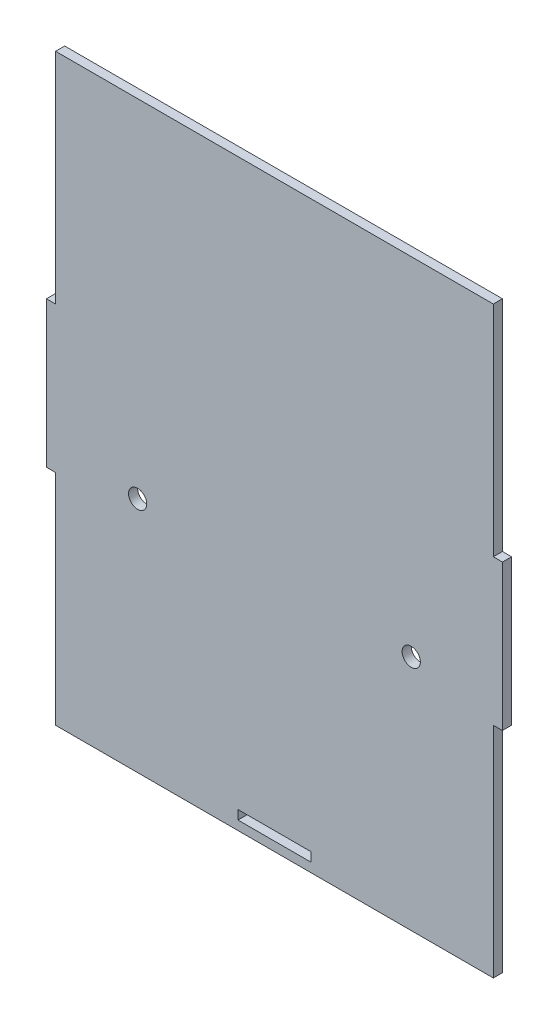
ISO-10303-21;
HEADER;
FILE_DESCRIPTION(('STEP AP214'),'2;1');
FILE_NAME('part.step','',(''),(''),'','','');
FILE_SCHEMA(('AUTOMOTIVE_DESIGN { 1 0 10303 214 1 1 1 1 }'));
ENDSEC;
DATA;
#1=APPLICATION_CONTEXT('core data for automotive mechanical design processes');
#2=APPLICATION_PROTOCOL_DEFINITION('international standard','automotive_design',2000,#1);
#3=PRODUCT_CONTEXT('',#1,'mechanical');
#4=PRODUCT('Part','Part','',(#3));
#5=PRODUCT_RELATED_PRODUCT_CATEGORY('part','',(#4));
#6=PRODUCT_DEFINITION_FORMATION('','',#4);
#7=PRODUCT_DEFINITION_CONTEXT('part definition',#1,'design');
#8=PRODUCT_DEFINITION('design','',#6,#7);
#9=PRODUCT_DEFINITION_SHAPE('','',#8);
#10=(LENGTH_UNIT() NAMED_UNIT(*) SI_UNIT(.MILLI.,.METRE.));
#11=(NAMED_UNIT(*) PLANE_ANGLE_UNIT() SI_UNIT($,.RADIAN.));
#12=(NAMED_UNIT(*) SI_UNIT($,.STERADIAN.) SOLID_ANGLE_UNIT());
#13=UNCERTAINTY_MEASURE_WITH_UNIT(LENGTH_MEASURE(1.E-05),#10,'distance_accuracy_value','');
#14=(GEOMETRIC_REPRESENTATION_CONTEXT(3) GLOBAL_UNCERTAINTY_ASSIGNED_CONTEXT((#13)) GLOBAL_UNIT_ASSIGNED_CONTEXT((#10,
#11,#12)) REPRESENTATION_CONTEXT('',''));
#15=CARTESIAN_POINT('',(0.,0.,0.));
#16=DIRECTION('',(0.,0.,1.));
#17=DIRECTION('',(1.,0.,0.));
#18=AXIS2_PLACEMENT_3D('',#15,#16,#17);
#19=CARTESIAN_POINT('',(-48.1057523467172,-47.8174502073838,3.175));
#20=DIRECTION('',(0.,0.,-1.));
#21=DIRECTION('',(-1.,0.,0.));
#22=AXIS2_PLACEMENT_3D('',#19,#20,#21);
#23=PLANE('',#22);
#24=CARTESIAN_POINT('',(-19.5307523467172,-92.2674502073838,3.175));
#25=DIRECTION('',(0.,0.,1.));
#26=DIRECTION('',(1.,0.,0.));
#27=AXIS2_PLACEMENT_3D('',#24,#25,#26);
#28=CIRCLE('',#27,3.175);
#29=CARTESIAN_POINT('',(-16.3557523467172,-92.2674502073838,3.175));
#30=VERTEX_POINT('',#29);
#31=EDGE_CURVE('E175',#30,#30,#28,.T.);
#32=ORIENTED_EDGE('',*,*,#31,.F.);
#33=EDGE_LOOP('',(#32));
#34=FACE_BOUND('',#33,.T.);
#35=DIRECTION('',(0.,-1.,0.));
#36=VECTOR('',#35,1.);
#37=CARTESIAN_POINT('',(-48.1057523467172,28.3825497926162,3.175));
#38=LINE('',#37,#36);
#39=CARTESIAN_POINT('',(-48.1057523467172,28.3825497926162,3.175));
#40=VERTEX_POINT('',#39);
#41=CARTESIAN_POINT('',(-48.1057523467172,-47.8174502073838,3.175));
#42=VERTEX_POINT('',#41);
#43=EDGE_CURVE('E185',#40,#42,#38,.T.);
#44=ORIENTED_EDGE('',*,*,#43,.T.);
#45=DIRECTION('',(-1.,0.,0.));
#46=VECTOR('',#45,1.);
#47=CARTESIAN_POINT('',(-48.1057523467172,-47.8174502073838,3.175));
#48=LINE('',#47,#46);
#49=CARTESIAN_POINT('',(-51.2807523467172,-47.8174502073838,3.175));
#50=VERTEX_POINT('',#49);
#51=EDGE_CURVE('E188',#42,#50,#48,.T.);
#52=ORIENTED_EDGE('',*,*,#51,.T.);
#53=DIRECTION('',(0.,-1.,0.));
#54=VECTOR('',#53,1.);
#55=CARTESIAN_POINT('',(-51.2807523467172,-47.8174502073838,3.175));
#56=LINE('',#55,#54);
#57=CARTESIAN_POINT('',(-51.2807523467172,-98.6174502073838,3.175));
#58=VERTEX_POINT('',#57);
#59=EDGE_CURVE('E191',#50,#58,#56,.T.);
#60=ORIENTED_EDGE('',*,*,#59,.T.);
#61=DIRECTION('',(1.,0.,0.));
#62=VECTOR('',#61,1.);
#63=CARTESIAN_POINT('',(-48.1057523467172,-98.6174502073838,3.175));
#64=LINE('',#63,#62);
#65=CARTESIAN_POINT('',(-48.1057523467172,-98.6174502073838,3.175));
#66=VERTEX_POINT('',#65);
#67=EDGE_CURVE('E193',#58,#66,#64,.T.);
#68=ORIENTED_EDGE('',*,*,#67,.T.);
#69=DIRECTION('',(0.,-1.,0.));
#70=VECTOR('',#69,1.);
#71=CARTESIAN_POINT('',(-48.1057523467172,-98.6174502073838,3.175));
#72=LINE('',#71,#70);
#73=CARTESIAN_POINT('',(-48.1057523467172,-174.817450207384,3.175));
#74=VERTEX_POINT('',#73);
#75=EDGE_CURVE('E195',#66,#74,#72,.T.);
#76=ORIENTED_EDGE('',*,*,#75,.T.);
#77=DIRECTION('',(1.,0.,0.));
#78=VECTOR('',#77,1.);
#79=CARTESIAN_POINT('',(-48.1057523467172,-174.817450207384,3.175));
#80=LINE('',#79,#78);
#81=CARTESIAN_POINT('',(104.294247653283,-174.817450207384,3.175));
#82=VERTEX_POINT('',#81);
#83=EDGE_CURVE('E197',#74,#82,#80,.T.);
#84=ORIENTED_EDGE('',*,*,#83,.T.);
#85=DIRECTION('',(0.,1.,0.));
#86=VECTOR('',#85,1.);
#87=CARTESIAN_POINT('',(104.294247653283,-98.6174502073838,3.175));
#88=LINE('',#87,#86);
#89=CARTESIAN_POINT('',(104.294247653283,-98.6174502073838,3.175));
#90=VERTEX_POINT('',#89);
#91=EDGE_CURVE('E199',#82,#90,#88,.T.);
#92=ORIENTED_EDGE('',*,*,#91,.T.);
#93=DIRECTION('',(1.,0.,0.));
#94=VECTOR('',#93,1.);
#95=CARTESIAN_POINT('',(104.294247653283,-98.6174502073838,3.175));
#96=LINE('',#95,#94);
#97=CARTESIAN_POINT('',(107.469247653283,-98.6174502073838,3.175));
#98=VERTEX_POINT('',#97);
#99=EDGE_CURVE('E201',#90,#98,#96,.T.);
#100=ORIENTED_EDGE('',*,*,#99,.T.);
#101=DIRECTION('',(0.,1.,0.));
#102=VECTOR('',#101,1.);
#103=CARTESIAN_POINT('',(107.469247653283,-47.8174502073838,3.175));
#104=LINE('',#103,#102);
#105=CARTESIAN_POINT('',(107.469247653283,-47.8174502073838,3.175));
#106=VERTEX_POINT('',#105);
#107=EDGE_CURVE('E203',#98,#106,#104,.T.);
#108=ORIENTED_EDGE('',*,*,#107,.T.);
#109=DIRECTION('',(-1.,0.,0.));
#110=VECTOR('',#109,1.);
#111=CARTESIAN_POINT('',(104.294247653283,-47.8174502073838,3.175));
#112=LINE('',#111,#110);
#113=CARTESIAN_POINT('',(104.294247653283,-47.8174502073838,3.175));
#114=VERTEX_POINT('',#113);
#115=EDGE_CURVE('E205',#106,#114,#112,.T.);
#116=ORIENTED_EDGE('',*,*,#115,.T.);
#117=DIRECTION('',(0.,1.,0.));
#118=VECTOR('',#117,1.);
#119=CARTESIAN_POINT('',(104.294247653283,28.3825497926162,3.175));
#120=LINE('',#119,#118);
#121=CARTESIAN_POINT('',(104.294247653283,28.3825497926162,3.175));
#122=VERTEX_POINT('',#121);
#123=EDGE_CURVE('E207',#114,#122,#120,.T.);
#124=ORIENTED_EDGE('',*,*,#123,.T.);
#125=DIRECTION('',(-1.,0.,0.));
#126=VECTOR('',#125,1.);
#127=CARTESIAN_POINT('',(-48.1057523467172,28.3825497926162,3.175));
#128=LINE('',#127,#126);
#129=EDGE_CURVE('E209',#122,#40,#128,.T.);
#130=ORIENTED_EDGE('',*,*,#129,.T.);
#131=EDGE_LOOP('',(#44,#52,#60,#68,#76,#84,#92,#100,#108,#116,#124,#130));
#132=FACE_BOUND('',#131,.T.);
#133=DIRECTION('',(0.,-1.,0.));
#134=VECTOR('',#133,1.);
#135=CARTESIAN_POINT('',(15.3942476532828,-168.467450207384,3.175));
#136=LINE('',#135,#134);
#137=CARTESIAN_POINT('',(15.3942476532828,-168.467450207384,3.175));
#138=VERTEX_POINT('',#137);
#139=CARTESIAN_POINT('',(15.3942476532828,-171.642450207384,3.175));
#140=VERTEX_POINT('',#139);
#141=EDGE_CURVE('E146',#138,#140,#136,.T.);
#142=ORIENTED_EDGE('',*,*,#141,.F.);
#143=DIRECTION('',(-1.,0.,0.));
#144=VECTOR('',#143,1.);
#145=CARTESIAN_POINT('',(15.3942476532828,-168.467450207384,3.175));
#146=LINE('',#145,#144);
#147=CARTESIAN_POINT('',(40.7942476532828,-168.467450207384,3.175));
#148=VERTEX_POINT('',#147);
#149=EDGE_CURVE('E169',#148,#138,#146,.T.);
#150=ORIENTED_EDGE('',*,*,#149,.F.);
#151=DIRECTION('',(0.,1.,0.));
#152=VECTOR('',#151,1.);
#153=CARTESIAN_POINT('',(40.7942476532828,-168.467450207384,3.175));
#154=LINE('',#153,#152);
#155=CARTESIAN_POINT('',(40.7942476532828,-171.642450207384,3.175));
#156=VERTEX_POINT('',#155);
#157=EDGE_CURVE('E167',#156,#148,#154,.T.);
#158=ORIENTED_EDGE('',*,*,#157,.F.);
#159=DIRECTION('',(1.,0.,0.));
#160=VECTOR('',#159,1.);
#161=CARTESIAN_POINT('',(15.3942476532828,-171.642450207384,3.175));
#162=LINE('',#161,#160);
#163=EDGE_CURVE('E154',#140,#156,#162,.T.);
#164=ORIENTED_EDGE('',*,*,#163,.F.);
#165=EDGE_LOOP('',(#142,#150,#158,#164));
#166=FACE_BOUND('',#165,.T.);
#167=CARTESIAN_POINT('',(75.7192476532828,-92.2674502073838,3.175));
#168=DIRECTION('',(0.,0.,1.));
#169=DIRECTION('',(1.,0.,0.));
#170=AXIS2_PLACEMENT_3D('',#167,#168,#169);
#171=CIRCLE('',#170,3.175);
#172=CARTESIAN_POINT('',(78.8942476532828,-92.2674502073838,3.175));
#173=VERTEX_POINT('',#172);
#174=EDGE_CURVE('E496',#173,#173,#171,.T.);
#175=ORIENTED_EDGE('',*,*,#174,.F.);
#176=EDGE_LOOP('',(#175));
#177=FACE_BOUND('',#176,.T.);
#178=ADVANCED_FACE('F33',(#34,#132,#166,#177),#23,.F.);
#179=CARTESIAN_POINT('',(-48.1057523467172,-47.8174502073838,0.));
#180=DIRECTION('',(0.,0.,-1.));
#181=DIRECTION('',(-1.,0.,0.));
#182=AXIS2_PLACEMENT_3D('',#179,#180,#181);
#183=PLANE('',#182);
#184=CARTESIAN_POINT('',(-19.5307523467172,-92.2674502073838,0.));
#185=DIRECTION('',(0.,0.,1.));
#186=DIRECTION('',(1.,0.,0.));
#187=AXIS2_PLACEMENT_3D('',#184,#185,#186);
#188=CIRCLE('',#187,3.175);
#189=CARTESIAN_POINT('',(-16.3557523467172,-92.2674502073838,0.));
#190=VERTEX_POINT('',#189);
#191=EDGE_CURVE('E502',#190,#190,#188,.T.);
#192=ORIENTED_EDGE('',*,*,#191,.T.);
#193=EDGE_LOOP('',(#192));
#194=FACE_BOUND('',#193,.T.);
#195=DIRECTION('',(0.,-1.,0.));
#196=VECTOR('',#195,1.);
#197=CARTESIAN_POINT('',(-48.1057523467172,28.3825497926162,0.));
#198=LINE('',#197,#196);
#199=CARTESIAN_POINT('',(-48.1057523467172,28.3825497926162,0.));
#200=VERTEX_POINT('',#199);
#201=CARTESIAN_POINT('',(-48.1057523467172,-47.8174502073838,0.));
#202=VERTEX_POINT('',#201);
#203=EDGE_CURVE('E162',#200,#202,#198,.T.);
#204=ORIENTED_EDGE('',*,*,#203,.F.);
#205=DIRECTION('',(-1.,0.,0.));
#206=VECTOR('',#205,1.);
#207=CARTESIAN_POINT('',(-48.1057523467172,28.3825497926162,0.));
#208=LINE('',#207,#206);
#209=CARTESIAN_POINT('',(104.294247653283,28.3825497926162,0.));
#210=VERTEX_POINT('',#209);
#211=EDGE_CURVE('E189',#210,#200,#208,.T.);
#212=ORIENTED_EDGE('',*,*,#211,.F.);
#213=DIRECTION('',(0.,1.,0.));
#214=VECTOR('',#213,1.);
#215=CARTESIAN_POINT('',(104.294247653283,28.3825497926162,0.));
#216=LINE('',#215,#214);
#217=CARTESIAN_POINT('',(104.294247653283,-47.8174502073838,0.));
#218=VERTEX_POINT('',#217);
#219=EDGE_CURVE('E232',#218,#210,#216,.T.);
#220=ORIENTED_EDGE('',*,*,#219,.F.);
#221=DIRECTION('',(-1.,0.,0.));
#222=VECTOR('',#221,1.);
#223=CARTESIAN_POINT('',(104.294247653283,-47.8174502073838,0.));
#224=LINE('',#223,#222);
#225=CARTESIAN_POINT('',(107.469247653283,-47.8174502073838,0.));
#226=VERTEX_POINT('',#225);
#227=EDGE_CURVE('E230',#226,#218,#224,.T.);
#228=ORIENTED_EDGE('',*,*,#227,.F.);
#229=DIRECTION('',(0.,1.,0.));
#230=VECTOR('',#229,1.);
#231=CARTESIAN_POINT('',(107.469247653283,-47.8174502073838,0.));
#232=LINE('',#231,#230);
#233=CARTESIAN_POINT('',(107.469247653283,-98.6174502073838,0.));
#234=VERTEX_POINT('',#233);
#235=EDGE_CURVE('E228',#234,#226,#232,.T.);
#236=ORIENTED_EDGE('',*,*,#235,.F.);
#237=DIRECTION('',(1.,0.,0.));
#238=VECTOR('',#237,1.);
#239=CARTESIAN_POINT('',(104.294247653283,-98.6174502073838,0.));
#240=LINE('',#239,#238);
#241=CARTESIAN_POINT('',(104.294247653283,-98.6174502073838,0.));
#242=VERTEX_POINT('',#241);
#243=EDGE_CURVE('E226',#242,#234,#240,.T.);
#244=ORIENTED_EDGE('',*,*,#243,.F.);
#245=DIRECTION('',(0.,1.,0.));
#246=VECTOR('',#245,1.);
#247=CARTESIAN_POINT('',(104.294247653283,-98.6174502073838,0.));
#248=LINE('',#247,#246);
#249=CARTESIAN_POINT('',(104.294247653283,-174.817450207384,0.));
#250=VERTEX_POINT('',#249);
#251=EDGE_CURVE('E224',#250,#242,#248,.T.);
#252=ORIENTED_EDGE('',*,*,#251,.F.);
#253=DIRECTION('',(1.,0.,0.));
#254=VECTOR('',#253,1.);
#255=CARTESIAN_POINT('',(-48.1057523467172,-174.817450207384,0.));
#256=LINE('',#255,#254);
#257=CARTESIAN_POINT('',(-48.1057523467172,-174.817450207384,0.));
#258=VERTEX_POINT('',#257);
#259=EDGE_CURVE('E222',#258,#250,#256,.T.);
#260=ORIENTED_EDGE('',*,*,#259,.F.);
#261=DIRECTION('',(0.,-1.,0.));
#262=VECTOR('',#261,1.);
#263=CARTESIAN_POINT('',(-48.1057523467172,-98.6174502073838,0.));
#264=LINE('',#263,#262);
#265=CARTESIAN_POINT('',(-48.1057523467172,-98.6174502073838,0.));
#266=VERTEX_POINT('',#265);
#267=EDGE_CURVE('E220',#266,#258,#264,.T.);
#268=ORIENTED_EDGE('',*,*,#267,.F.);
#269=DIRECTION('',(1.,0.,0.));
#270=VECTOR('',#269,1.);
#271=CARTESIAN_POINT('',(-48.1057523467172,-98.6174502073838,0.));
#272=LINE('',#271,#270);
#273=CARTESIAN_POINT('',(-51.2807523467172,-98.6174502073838,0.));
#274=VERTEX_POINT('',#273);
#275=EDGE_CURVE('E218',#274,#266,#272,.T.);
#276=ORIENTED_EDGE('',*,*,#275,.F.);
#277=DIRECTION('',(0.,-1.,0.));
#278=VECTOR('',#277,1.);
#279=CARTESIAN_POINT('',(-51.2807523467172,-47.8174502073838,0.));
#280=LINE('',#279,#278);
#281=CARTESIAN_POINT('',(-51.2807523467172,-47.8174502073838,0.));
#282=VERTEX_POINT('',#281);
#283=EDGE_CURVE('E216',#282,#274,#280,.T.);
#284=ORIENTED_EDGE('',*,*,#283,.F.);
#285=DIRECTION('',(-1.,0.,0.));
#286=VECTOR('',#285,1.);
#287=CARTESIAN_POINT('',(-48.1057523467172,-47.8174502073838,0.));
#288=LINE('',#287,#286);
#289=EDGE_CURVE('E214',#202,#282,#288,.T.);
#290=ORIENTED_EDGE('',*,*,#289,.F.);
#291=EDGE_LOOP('',(#204,#212,#220,#228,#236,#244,#252,#260,#268,#276,#284,#290));
#292=FACE_BOUND('',#291,.T.);
#293=DIRECTION('',(-1.,0.,0.));
#294=VECTOR('',#293,1.);
#295=CARTESIAN_POINT('',(15.3942476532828,-168.467450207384,0.));
#296=LINE('',#295,#294);
#297=CARTESIAN_POINT('',(40.7942476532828,-168.467450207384,0.));
#298=VERTEX_POINT('',#297);
#299=CARTESIAN_POINT('',(15.3942476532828,-168.467450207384,0.));
#300=VERTEX_POINT('',#299);
#301=EDGE_CURVE('E155',#298,#300,#296,.T.);
#302=ORIENTED_EDGE('',*,*,#301,.T.);
#303=DIRECTION('',(0.,-1.,0.));
#304=VECTOR('',#303,1.);
#305=CARTESIAN_POINT('',(15.3942476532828,-168.467450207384,0.));
#306=LINE('',#305,#304);
#307=CARTESIAN_POINT('',(15.3942476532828,-171.642450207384,0.));
#308=VERTEX_POINT('',#307);
#309=EDGE_CURVE('E56',#300,#308,#306,.T.);
#310=ORIENTED_EDGE('',*,*,#309,.T.);
#311=DIRECTION('',(1.,0.,0.));
#312=VECTOR('',#311,1.);
#313=CARTESIAN_POINT('',(15.3942476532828,-171.642450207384,0.));
#314=LINE('',#313,#312);
#315=CARTESIAN_POINT('',(40.7942476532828,-171.642450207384,0.));
#316=VERTEX_POINT('',#315);
#317=EDGE_CURVE('E161',#308,#316,#314,.T.);
#318=ORIENTED_EDGE('',*,*,#317,.T.);
#319=DIRECTION('',(0.,1.,0.));
#320=VECTOR('',#319,1.);
#321=CARTESIAN_POINT('',(40.7942476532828,-168.467450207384,0.));
#322=LINE('',#321,#320);
#323=EDGE_CURVE('E177',#316,#298,#322,.T.);
#324=ORIENTED_EDGE('',*,*,#323,.T.);
#325=EDGE_LOOP('',(#302,#310,#318,#324));
#326=FACE_BOUND('',#325,.T.);
#327=CARTESIAN_POINT('',(75.7192476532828,-92.2674502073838,0.));
#328=DIRECTION('',(0.,0.,1.));
#329=DIRECTION('',(1.,0.,0.));
#330=AXIS2_PLACEMENT_3D('',#327,#328,#329);
#331=CIRCLE('',#330,3.175);
#332=CARTESIAN_POINT('',(78.8942476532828,-92.2674502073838,0.));
#333=VERTEX_POINT('',#332);
#334=EDGE_CURVE('E499',#333,#333,#331,.T.);
#335=ORIENTED_EDGE('',*,*,#334,.T.);
#336=EDGE_LOOP('',(#335));
#337=FACE_BOUND('',#336,.T.);
#338=ADVANCED_FACE('F274',(#194,#292,#326,#337),#183,.T.);
#339=CARTESIAN_POINT('',(-48.1057523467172,28.3825497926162,3.175));
#340=DIRECTION('',(1.,0.,0.));
#341=DIRECTION('',(0.,0.,-1.));
#342=AXIS2_PLACEMENT_3D('',#339,#340,#341);
#343=PLANE('',#342);
#344=ORIENTED_EDGE('',*,*,#203,.T.);
#345=DIRECTION('',(0.,0.,-1.));
#346=VECTOR('',#345,1.);
#347=CARTESIAN_POINT('',(-48.1057523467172,-47.8174502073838,3.175));
#348=LINE('',#347,#346);
#349=EDGE_CURVE('E11',#42,#202,#348,.T.);
#350=ORIENTED_EDGE('',*,*,#349,.F.);
#351=ORIENTED_EDGE('',*,*,#43,.F.);
#352=DIRECTION('',(0.,0.,-1.));
#353=VECTOR('',#352,1.);
#354=CARTESIAN_POINT('',(-48.1057523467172,28.3825497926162,3.175));
#355=LINE('',#354,#353);
#356=EDGE_CURVE('E211',#40,#200,#355,.T.);
#357=ORIENTED_EDGE('',*,*,#356,.T.);
#358=EDGE_LOOP('',(#344,#350,#351,#357));
#359=FACE_BOUND('',#358,.T.);
#360=ADVANCED_FACE('F35',(#359),#343,.F.);
#361=CARTESIAN_POINT('',(-48.1057523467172,-47.8174502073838,3.175));
#362=DIRECTION('',(0.,-1.,0.));
#363=DIRECTION('',(0.,0.,-1.));
#364=AXIS2_PLACEMENT_3D('',#361,#362,#363);
#365=PLANE('',#364);
#366=ORIENTED_EDGE('',*,*,#289,.T.);
#367=DIRECTION('',(0.,0.,-1.));
#368=VECTOR('',#367,1.);
#369=CARTESIAN_POINT('',(-51.2807523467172,-47.8174502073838,3.175));
#370=LINE('',#369,#368);
#371=EDGE_CURVE('E41',#50,#282,#370,.T.);
#372=ORIENTED_EDGE('',*,*,#371,.F.);
#373=ORIENTED_EDGE('',*,*,#51,.F.);
#374=ORIENTED_EDGE('',*,*,#349,.T.);
#375=EDGE_LOOP('',(#366,#372,#373,#374));
#376=FACE_BOUND('',#375,.T.);
#377=ADVANCED_FACE('F291',(#376),#365,.F.);
#378=CARTESIAN_POINT('',(-51.2807523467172,-47.8174502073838,3.175));
#379=DIRECTION('',(1.,0.,0.));
#380=DIRECTION('',(0.,1.,0.));
#381=AXIS2_PLACEMENT_3D('',#378,#379,#380);
#382=PLANE('',#381);
#383=ORIENTED_EDGE('',*,*,#283,.T.);
#384=DIRECTION('',(0.,0.,-1.));
#385=VECTOR('',#384,1.);
#386=CARTESIAN_POINT('',(-51.2807523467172,-98.6174502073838,3.175));
#387=LINE('',#386,#385);
#388=EDGE_CURVE('E261',#58,#274,#387,.T.);
#389=ORIENTED_EDGE('',*,*,#388,.F.);
#390=ORIENTED_EDGE('',*,*,#59,.F.);
#391=ORIENTED_EDGE('',*,*,#371,.T.);
#392=EDGE_LOOP('',(#383,#389,#390,#391));
#393=FACE_BOUND('',#392,.T.);
#394=ADVANCED_FACE('F268',(#393),#382,.F.);
#395=CARTESIAN_POINT('',(-48.1057523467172,-98.6174502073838,3.175));
#396=DIRECTION('',(0.,1.,0.));
#397=DIRECTION('',(0.,0.,1.));
#398=AXIS2_PLACEMENT_3D('',#395,#396,#397);
#399=PLANE('',#398);
#400=ORIENTED_EDGE('',*,*,#275,.T.);
#401=DIRECTION('',(0.,0.,-1.));
#402=VECTOR('',#401,1.);
#403=CARTESIAN_POINT('',(-48.1057523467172,-98.6174502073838,3.175));
#404=LINE('',#403,#402);
#405=EDGE_CURVE('E258',#66,#266,#404,.T.);
#406=ORIENTED_EDGE('',*,*,#405,.F.);
#407=ORIENTED_EDGE('',*,*,#67,.F.);
#408=ORIENTED_EDGE('',*,*,#388,.T.);
#409=EDGE_LOOP('',(#400,#406,#407,#408));
#410=FACE_BOUND('',#409,.T.);
#411=ADVANCED_FACE('F280',(#410),#399,.F.);
#412=CARTESIAN_POINT('',(-48.1057523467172,-98.6174502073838,3.175));
#413=DIRECTION('',(1.,0.,0.));
#414=DIRECTION('',(0.,1.,0.));
#415=AXIS2_PLACEMENT_3D('',#412,#413,#414);
#416=PLANE('',#415);
#417=ORIENTED_EDGE('',*,*,#267,.T.);
#418=DIRECTION('',(0.,0.,-1.));
#419=VECTOR('',#418,1.);
#420=CARTESIAN_POINT('',(-48.1057523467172,-174.817450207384,3.175));
#421=LINE('',#420,#419);
#422=EDGE_CURVE('E255',#74,#258,#421,.T.);
#423=ORIENTED_EDGE('',*,*,#422,.F.);
#424=ORIENTED_EDGE('',*,*,#75,.F.);
#425=ORIENTED_EDGE('',*,*,#405,.T.);
#426=EDGE_LOOP('',(#417,#423,#424,#425));
#427=FACE_BOUND('',#426,.T.);
#428=ADVANCED_FACE('F284',(#427),#416,.F.);
#429=CARTESIAN_POINT('',(-48.1057523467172,-174.817450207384,3.175));
#430=DIRECTION('',(0.,1.,0.));
#431=DIRECTION('',(-1.,0.,0.));
#432=AXIS2_PLACEMENT_3D('',#429,#430,#431);
#433=PLANE('',#432);
#434=ORIENTED_EDGE('',*,*,#259,.T.);
#435=DIRECTION('',(0.,0.,-1.));
#436=VECTOR('',#435,1.);
#437=CARTESIAN_POINT('',(104.294247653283,-174.817450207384,3.175));
#438=LINE('',#437,#436);
#439=EDGE_CURVE('E252',#82,#250,#438,.T.);
#440=ORIENTED_EDGE('',*,*,#439,.F.);
#441=ORIENTED_EDGE('',*,*,#83,.F.);
#442=ORIENTED_EDGE('',*,*,#422,.T.);
#443=EDGE_LOOP('',(#434,#440,#441,#442));
#444=FACE_BOUND('',#443,.T.);
#445=ADVANCED_FACE('F324',(#444),#433,.F.);
#446=CARTESIAN_POINT('',(104.294247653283,-98.6174502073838,3.175));
#447=DIRECTION('',(-1.,0.,0.));
#448=DIRECTION('',(0.,0.,1.));
#449=AXIS2_PLACEMENT_3D('',#446,#447,#448);
#450=PLANE('',#449);
#451=ORIENTED_EDGE('',*,*,#251,.T.);
#452=DIRECTION('',(0.,0.,-1.));
#453=VECTOR('',#452,1.);
#454=CARTESIAN_POINT('',(104.294247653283,-98.6174502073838,3.175));
#455=LINE('',#454,#453);
#456=EDGE_CURVE('E249',#90,#242,#455,.T.);
#457=ORIENTED_EDGE('',*,*,#456,.F.);
#458=ORIENTED_EDGE('',*,*,#91,.F.);
#459=ORIENTED_EDGE('',*,*,#439,.T.);
#460=EDGE_LOOP('',(#451,#457,#458,#459));
#461=FACE_BOUND('',#460,.T.);
#462=ADVANCED_FACE('F322',(#461),#450,.F.);
#463=CARTESIAN_POINT('',(104.294247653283,-98.6174502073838,3.175));
#464=DIRECTION('',(0.,1.,0.));
#465=DIRECTION('',(0.,0.,1.));
#466=AXIS2_PLACEMENT_3D('',#463,#464,#465);
#467=PLANE('',#466);
#468=ORIENTED_EDGE('',*,*,#243,.T.);
#469=DIRECTION('',(0.,0.,-1.));
#470=VECTOR('',#469,1.);
#471=CARTESIAN_POINT('',(107.469247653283,-98.6174502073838,3.175));
#472=LINE('',#471,#470);
#473=EDGE_CURVE('E246',#98,#234,#472,.T.);
#474=ORIENTED_EDGE('',*,*,#473,.F.);
#475=ORIENTED_EDGE('',*,*,#99,.F.);
#476=ORIENTED_EDGE('',*,*,#456,.T.);
#477=EDGE_LOOP('',(#468,#474,#475,#476));
#478=FACE_BOUND('',#477,.T.);
#479=ADVANCED_FACE('F318',(#478),#467,.F.);
#480=CARTESIAN_POINT('',(107.469247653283,-47.8174502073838,3.175));
#481=DIRECTION('',(-1.,0.,0.));
#482=DIRECTION('',(0.,-1.,0.));
#483=AXIS2_PLACEMENT_3D('',#480,#481,#482);
#484=PLANE('',#483);
#485=ORIENTED_EDGE('',*,*,#235,.T.);
#486=DIRECTION('',(0.,0.,-1.));
#487=VECTOR('',#486,1.);
#488=CARTESIAN_POINT('',(107.469247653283,-47.8174502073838,3.175));
#489=LINE('',#488,#487);
#490=EDGE_CURVE('E243',#106,#226,#489,.T.);
#491=ORIENTED_EDGE('',*,*,#490,.F.);
#492=ORIENTED_EDGE('',*,*,#107,.F.);
#493=ORIENTED_EDGE('',*,*,#473,.T.);
#494=EDGE_LOOP('',(#485,#491,#492,#493));
#495=FACE_BOUND('',#494,.T.);
#496=ADVANCED_FACE('F313',(#495),#484,.F.);
#497=CARTESIAN_POINT('',(104.294247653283,-47.8174502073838,3.175));
#498=DIRECTION('',(0.,-1.,0.));
#499=DIRECTION('',(0.,0.,-1.));
#500=AXIS2_PLACEMENT_3D('',#497,#498,#499);
#501=PLANE('',#500);
#502=ORIENTED_EDGE('',*,*,#227,.T.);
#503=DIRECTION('',(0.,0.,-1.));
#504=VECTOR('',#503,1.);
#505=CARTESIAN_POINT('',(104.294247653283,-47.8174502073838,3.175));
#506=LINE('',#505,#504);
#507=EDGE_CURVE('E240',#114,#218,#506,.T.);
#508=ORIENTED_EDGE('',*,*,#507,.F.);
#509=ORIENTED_EDGE('',*,*,#115,.F.);
#510=ORIENTED_EDGE('',*,*,#490,.T.);
#511=EDGE_LOOP('',(#502,#508,#509,#510));
#512=FACE_BOUND('',#511,.T.);
#513=ADVANCED_FACE('F307',(#512),#501,.F.);
#514=CARTESIAN_POINT('',(104.294247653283,28.3825497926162,3.175));
#515=DIRECTION('',(-1.,0.,0.));
#516=DIRECTION('',(0.,-1.,0.));
#517=AXIS2_PLACEMENT_3D('',#514,#515,#516);
#518=PLANE('',#517);
#519=ORIENTED_EDGE('',*,*,#219,.T.);
#520=DIRECTION('',(0.,0.,-1.));
#521=VECTOR('',#520,1.);
#522=CARTESIAN_POINT('',(104.294247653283,28.3825497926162,3.175));
#523=LINE('',#522,#521);
#524=EDGE_CURVE('E237',#122,#210,#523,.T.);
#525=ORIENTED_EDGE('',*,*,#524,.F.);
#526=ORIENTED_EDGE('',*,*,#123,.F.);
#527=ORIENTED_EDGE('',*,*,#507,.T.);
#528=EDGE_LOOP('',(#519,#525,#526,#527));
#529=FACE_BOUND('',#528,.T.);
#530=ADVANCED_FACE('F303',(#529),#518,.F.);
#531=CARTESIAN_POINT('',(-48.1057523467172,28.3825497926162,3.175));
#532=DIRECTION('',(0.,-1.,0.));
#533=DIRECTION('',(1.,0.,0.));
#534=AXIS2_PLACEMENT_3D('',#531,#532,#533);
#535=PLANE('',#534);
#536=ORIENTED_EDGE('',*,*,#211,.T.);
#537=ORIENTED_EDGE('',*,*,#356,.F.);
#538=ORIENTED_EDGE('',*,*,#129,.F.);
#539=ORIENTED_EDGE('',*,*,#524,.T.);
#540=EDGE_LOOP('',(#536,#537,#538,#539));
#541=FACE_BOUND('',#540,.T.);
#542=ADVANCED_FACE('F298',(#541),#535,.F.);
#543=CARTESIAN_POINT('',(15.3942476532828,-168.467450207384,3.175));
#544=DIRECTION('',(1.,0.,0.));
#545=DIRECTION('',(0.,1.,0.));
#546=AXIS2_PLACEMENT_3D('',#543,#544,#545);
#547=PLANE('',#546);
#548=ORIENTED_EDGE('',*,*,#309,.F.);
#549=DIRECTION('',(0.,0.,-1.));
#550=VECTOR('',#549,1.);
#551=CARTESIAN_POINT('',(15.3942476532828,-168.467450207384,3.175));
#552=LINE('',#551,#550);
#553=EDGE_CURVE('E150',#138,#300,#552,.T.);
#554=ORIENTED_EDGE('',*,*,#553,.F.);
#555=ORIENTED_EDGE('',*,*,#141,.T.);
#556=DIRECTION('',(0.,0.,-1.));
#557=VECTOR('',#556,1.);
#558=CARTESIAN_POINT('',(15.3942476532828,-171.642450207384,3.175));
#559=LINE('',#558,#557);
#560=EDGE_CURVE('E149',#140,#308,#559,.T.);
#561=ORIENTED_EDGE('',*,*,#560,.T.);
#562=EDGE_LOOP('',(#548,#554,#555,#561));
#563=FACE_BOUND('',#562,.T.);
#564=ADVANCED_FACE('F148',(#563),#547,.T.);
#565=CARTESIAN_POINT('',(15.3942476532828,-171.642450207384,3.175));
#566=DIRECTION('',(0.,1.,0.));
#567=DIRECTION('',(0.,0.,1.));
#568=AXIS2_PLACEMENT_3D('',#565,#566,#567);
#569=PLANE('',#568);
#570=ORIENTED_EDGE('',*,*,#317,.F.);
#571=ORIENTED_EDGE('',*,*,#560,.F.);
#572=ORIENTED_EDGE('',*,*,#163,.T.);
#573=DIRECTION('',(0.,0.,-1.));
#574=VECTOR('',#573,1.);
#575=CARTESIAN_POINT('',(40.7942476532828,-171.642450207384,3.175));
#576=LINE('',#575,#574);
#577=EDGE_CURVE('E163',#156,#316,#576,.T.);
#578=ORIENTED_EDGE('',*,*,#577,.T.);
#579=EDGE_LOOP('',(#570,#571,#572,#578));
#580=FACE_BOUND('',#579,.T.);
#581=ADVANCED_FACE('F158',(#580),#569,.T.);
#582=CARTESIAN_POINT('',(40.7942476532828,-168.467450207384,3.175));
#583=DIRECTION('',(-1.,0.,0.));
#584=DIRECTION('',(0.,0.,1.));
#585=AXIS2_PLACEMENT_3D('',#582,#583,#584);
#586=PLANE('',#585);
#587=ORIENTED_EDGE('',*,*,#323,.F.);
#588=ORIENTED_EDGE('',*,*,#577,.F.);
#589=ORIENTED_EDGE('',*,*,#157,.T.);
#590=DIRECTION('',(0.,0.,-1.));
#591=VECTOR('',#590,1.);
#592=CARTESIAN_POINT('',(40.7942476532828,-168.467450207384,3.175));
#593=LINE('',#592,#591);
#594=EDGE_CURVE('E48',#148,#298,#593,.T.);
#595=ORIENTED_EDGE('',*,*,#594,.T.);
#596=EDGE_LOOP('',(#587,#588,#589,#595));
#597=FACE_BOUND('',#596,.T.);
#598=ADVANCED_FACE('F385',(#597),#586,.T.);
#599=CARTESIAN_POINT('',(15.3942476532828,-168.467450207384,3.175));
#600=DIRECTION('',(0.,-1.,0.));
#601=DIRECTION('',(0.,0.,-1.));
#602=AXIS2_PLACEMENT_3D('',#599,#600,#601);
#603=PLANE('',#602);
#604=ORIENTED_EDGE('',*,*,#301,.F.);
#605=ORIENTED_EDGE('',*,*,#594,.F.);
#606=ORIENTED_EDGE('',*,*,#149,.T.);
#607=ORIENTED_EDGE('',*,*,#553,.T.);
#608=EDGE_LOOP('',(#604,#605,#606,#607));
#609=FACE_BOUND('',#608,.T.);
#610=ADVANCED_FACE('F391',(#609),#603,.T.);
#611=CARTESIAN_POINT('',(-19.5307523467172,-92.2674502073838,3.175));
#612=DIRECTION('',(0.,0.,-1.));
#613=DIRECTION('',(-1.,0.,0.));
#614=AXIS2_PLACEMENT_3D('',#611,#612,#613);
#615=CYLINDRICAL_SURFACE('',#614,3.175);
#616=ORIENTED_EDGE('',*,*,#31,.T.);
#617=EDGE_LOOP('',(#616));
#618=FACE_BOUND('',#617,.T.);
#619=ORIENTED_EDGE('',*,*,#191,.F.);
#620=EDGE_LOOP('',(#619));
#621=FACE_BOUND('',#620,.T.);
#622=ADVANCED_FACE('F399',(#618,#621),#615,.F.);
#623=CARTESIAN_POINT('',(75.7192476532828,-92.2674502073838,3.175));
#624=DIRECTION('',(0.,0.,-1.));
#625=DIRECTION('',(-1.,0.,0.));
#626=AXIS2_PLACEMENT_3D('',#623,#624,#625);
#627=CYLINDRICAL_SURFACE('',#626,3.175);
#628=ORIENTED_EDGE('',*,*,#174,.T.);
#629=EDGE_LOOP('',(#628));
#630=FACE_BOUND('',#629,.T.);
#631=ORIENTED_EDGE('',*,*,#334,.F.);
#632=EDGE_LOOP('',(#631));
#633=FACE_BOUND('',#632,.T.);
#634=ADVANCED_FACE('F406',(#630,#633),#627,.F.);
#635=CLOSED_SHELL('',(#178,#338,#360,#377,#394,#411,#428,#445,#462,#479,#496,#513,#530,#542,
#564,#581,#598,#610,#622,#634));
#636=MANIFOLD_SOLID_BREP('B2',#635);
#637=ADVANCED_BREP_SHAPE_REPRESENTATION('',(#18,#636),#14);
#638=SHAPE_DEFINITION_REPRESENTATION(#9,#637);
ENDSEC;
END-ISO-10303-21;
